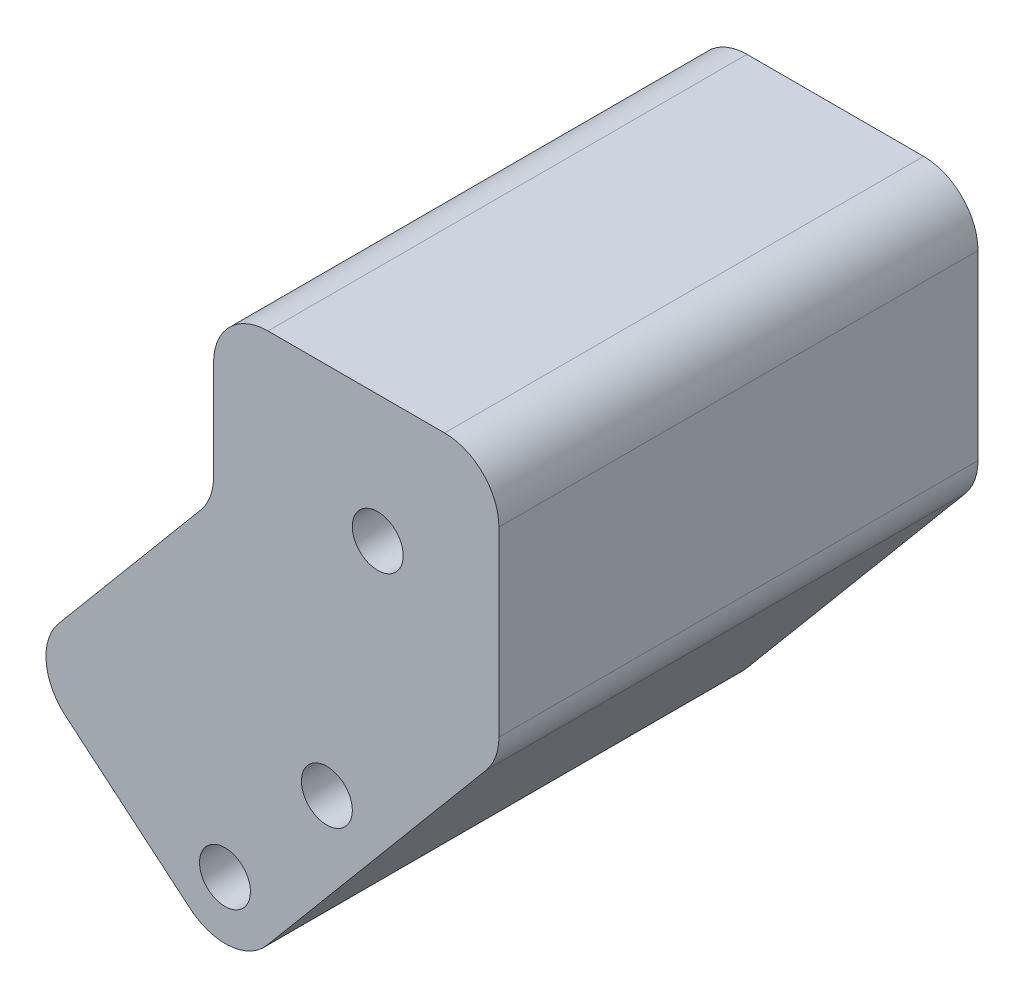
ISO-10303-21;
HEADER;
FILE_DESCRIPTION(('STEP AP214'),'2;1');
FILE_NAME('part.step','',(''),(''),'','','');
FILE_SCHEMA(('AUTOMOTIVE_DESIGN { 1 0 10303 214 1 1 1 1 }'));
ENDSEC;
DATA;
#1=APPLICATION_CONTEXT('core data for automotive mechanical design processes');
#2=APPLICATION_PROTOCOL_DEFINITION('international standard','automotive_design',2000,#1);
#3=PRODUCT_CONTEXT('',#1,'mechanical');
#4=PRODUCT('Part','Part','',(#3));
#5=PRODUCT_RELATED_PRODUCT_CATEGORY('part','',(#4));
#6=PRODUCT_DEFINITION_FORMATION('','',#4);
#7=PRODUCT_DEFINITION_CONTEXT('part definition',#1,'design');
#8=PRODUCT_DEFINITION('design','',#6,#7);
#9=PRODUCT_DEFINITION_SHAPE('','',#8);
#10=(LENGTH_UNIT() NAMED_UNIT(*) SI_UNIT(.MILLI.,.METRE.));
#11=(NAMED_UNIT(*) PLANE_ANGLE_UNIT() SI_UNIT($,.RADIAN.));
#12=(NAMED_UNIT(*) SI_UNIT($,.STERADIAN.) SOLID_ANGLE_UNIT());
#13=UNCERTAINTY_MEASURE_WITH_UNIT(LENGTH_MEASURE(1.E-05),#10,'distance_accuracy_value','');
#14=(GEOMETRIC_REPRESENTATION_CONTEXT(3) GLOBAL_UNCERTAINTY_ASSIGNED_CONTEXT((#13)) GLOBAL_UNIT_ASSIGNED_CONTEXT((#10,
#11,#12)) REPRESENTATION_CONTEXT('',''));
#15=CARTESIAN_POINT('',(0.,0.,0.));
#16=DIRECTION('',(0.,0.,1.));
#17=DIRECTION('',(1.,0.,0.));
#18=AXIS2_PLACEMENT_3D('',#15,#16,#17);
#19=CARTESIAN_POINT('',(-7.60502771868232E-11,2.46469511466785E-11,4.79986189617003));
#20=DIRECTION('',(-1.58417609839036E-11,5.13786431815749E-12,1.));
#21=DIRECTION('',(1.,0.,1.58417609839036E-11));
#22=AXIS2_PLACEMENT_3D('',#19,#20,#21);
#23=PLANE('',#22);
#24=CARTESIAN_POINT('',(-583.738510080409,-82.5166423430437,4.79986188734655));
#25=DIRECTION('',(0.,-5.13786431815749E-12,-1.));
#26=DIRECTION('',(0.,1.,-5.13786431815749E-12));
#27=AXIS2_PLACEMENT_3D('',#24,#25,#26);
#28=CIRCLE('',#27,5.35940000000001);
#29=CARTESIAN_POINT('',(-583.738510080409,-77.1572423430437,4.79986188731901));
#30=VERTEX_POINT('',#29);
#31=EDGE_CURVE('E341',#30,#30,#28,.T.);
#32=ORIENTED_EDGE('',*,*,#31,.F.);
#33=EDGE_LOOP('',(#32));
#34=FACE_BOUND('',#33,.T.);
#35=CARTESIAN_POINT('',(-562.323795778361,-31.0085922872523,4.79986188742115));
#36=DIRECTION('',(0.,-5.13786431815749E-12,-1.));
#37=DIRECTION('',(0.,1.,-5.13786431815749E-12));
#38=AXIS2_PLACEMENT_3D('',#35,#36,#37);
#39=CIRCLE('',#38,5.35940000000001);
#40=CARTESIAN_POINT('',(-562.323795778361,-25.6491922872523,4.79986188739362));
#41=VERTEX_POINT('',#40);
#42=EDGE_CURVE('E325',#41,#41,#39,.T.);
#43=ORIENTED_EDGE('',*,*,#42,.F.);
#44=EDGE_LOOP('',(#43));
#45=FACE_BOUND('',#44,.T.);
#46=CARTESIAN_POINT('',(-569.452555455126,-65.4913045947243,4.79986188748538));
#47=DIRECTION('',(0.,-5.13786431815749E-12,-1.));
#48=DIRECTION('',(0.,1.,-5.13786431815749E-12));
#49=AXIS2_PLACEMENT_3D('',#46,#47,#48);
#50=CIRCLE('',#49,5.35940000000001);
#51=CARTESIAN_POINT('',(-569.452555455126,-60.1319045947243,4.79986188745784));
#52=VERTEX_POINT('',#51);
#53=EDGE_CURVE('E309',#52,#52,#50,.T.);
#54=ORIENTED_EDGE('',*,*,#53,.F.);
#55=EDGE_LOOP('',(#54));
#56=FACE_BOUND('',#55,.T.);
#57=CARTESIAN_POINT('',(-577.716152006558,-20.8198728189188,4.79986188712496));
#58=DIRECTION('',(-1.58417609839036E-11,5.13786431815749E-12,1.));
#59=DIRECTION('',(1.,0.,1.58417609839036E-11));
#60=AXIS2_PLACEMENT_3D('',#57,#58,#59);
#61=CIRCLE('',#60,7.61999999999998);
#62=CARTESIAN_POINT('',(-577.716152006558,-13.1998728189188,4.79986188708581));
#63=VERTEX_POINT('',#62);
#64=CARTESIAN_POINT('',(-585.336152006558,-20.8198728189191,4.79986188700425));
#65=VERTEX_POINT('',#64);
#66=EDGE_CURVE('E136',#63,#65,#61,.T.);
#67=ORIENTED_EDGE('',*,*,#66,.F.);
#68=DIRECTION('',(-1.,0.,-1.58417609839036E-11));
#69=VECTOR('',#68,1.);
#70=CARTESIAN_POINT('',(-577.716152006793,-13.1998728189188,4.79986188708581));
#71=LINE('',#70,#69);
#72=CARTESIAN_POINT('',(-552.951152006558,-13.1998728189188,4.79986188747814));
#73=VERTEX_POINT('',#72);
#74=EDGE_CURVE('E143',#73,#63,#71,.T.);
#75=ORIENTED_EDGE('',*,*,#74,.F.);
#76=CARTESIAN_POINT('',(-552.951152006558,-20.8198728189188,4.79986188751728));
#77=DIRECTION('',(-1.58417609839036E-11,5.13786431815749E-12,1.));
#78=DIRECTION('',(1.,0.,1.58417609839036E-11));
#79=AXIS2_PLACEMENT_3D('',#76,#77,#78);
#80=CIRCLE('',#79,7.61999999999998);
#81=CARTESIAN_POINT('',(-545.331152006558,-20.8198728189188,4.79986188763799));
#82=VERTEX_POINT('',#81);
#83=EDGE_CURVE('E285',#82,#73,#80,.T.);
#84=ORIENTED_EDGE('',*,*,#83,.F.);
#85=DIRECTION('',(0.,1.,-5.13786431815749E-12));
#86=VECTOR('',#85,1.);
#87=CARTESIAN_POINT('',(-545.331152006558,-20.8198728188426,4.79986188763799));
#88=LINE('',#87,#86);
#89=CARTESIAN_POINT('',(-545.331152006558,-46.319640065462,4.79986188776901));
#90=VERTEX_POINT('',#89);
#91=EDGE_CURVE('E281',#90,#82,#88,.T.);
#92=ORIENTED_EDGE('',*,*,#91,.F.);
#93=CARTESIAN_POINT('',(-552.951152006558,-46.319640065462,4.79986188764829));
#94=DIRECTION('',(-1.58417609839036E-11,5.13786431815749E-12,1.));
#95=DIRECTION('',(1.,0.,1.58417609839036E-11));
#96=AXIS2_PLACEMENT_3D('',#93,#94,#95);
#97=CIRCLE('',#96,7.61999999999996);
#98=CARTESIAN_POINT('',(-547.113893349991,-51.2176816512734,4.79986188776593));
#99=VERTEX_POINT('',#98);
#100=EDGE_CURVE('E291',#99,#90,#97,.T.);
#101=ORIENTED_EDGE('',*,*,#100,.F.);
#102=DIRECTION('',(0.642787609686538,0.766044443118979,6.24705526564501E-12));
#103=VECTOR('',#102,1.);
#104=CARTESIAN_POINT('',(-547.113893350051,-51.2176816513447,4.79986188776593));
#105=LINE('',#104,#103);
#106=CARTESIAN_POINT('',(-577.862117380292,-87.8619881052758,4.7998618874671));
#107=VERTEX_POINT('',#106);
#108=EDGE_CURVE('E272',#107,#99,#105,.T.);
#109=ORIENTED_EDGE('',*,*,#108,.F.);
#110=CARTESIAN_POINT('',(-583.699376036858,-82.9639465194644,4.79986188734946));
#111=DIRECTION('',(-1.58417609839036E-11,5.13786431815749E-12,1.));
#112=DIRECTION('',(1.,0.,1.58417609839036E-11));
#113=AXIS2_PLACEMENT_3D('',#110,#111,#112);
#114=CIRCLE('',#113,7.62000000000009);
#115=CARTESIAN_POINT('',(-588.59741762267,-88.801205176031,4.79986188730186));
#116=VERTEX_POINT('',#115);
#117=EDGE_CURVE('E267',#116,#107,#114,.T.);
#118=ORIENTED_EDGE('',*,*,#117,.F.);
#119=DIRECTION('',(0.766044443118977,-0.642787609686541,1.54380484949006E-11));
#120=VECTOR('',#119,1.);
#121=CARTESIAN_POINT('',(-588.597417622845,-88.8012051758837,4.79986188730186));
#122=LINE('',#121,#120);
#123=CARTESIAN_POINT('',(-606.109193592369,-74.1070804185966,4.79986188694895));
#124=VERTEX_POINT('',#123);
#125=EDGE_CURVE('E300',#124,#116,#122,.T.);
#126=ORIENTED_EDGE('',*,*,#125,.F.);
#127=CARTESIAN_POINT('',(-601.211152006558,-68.2698217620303,4.79986188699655));
#128=DIRECTION('',(-1.58417609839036E-11,5.13786431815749E-12,1.));
#129=DIRECTION('',(1.,0.,1.58417609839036E-11));
#130=AXIS2_PLACEMENT_3D('',#127,#128,#129);
#131=CIRCLE('',#130,7.62000000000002);
#132=CARTESIAN_POINT('',(-607.048410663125,-63.3717801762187,4.79986188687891));
#133=VERTEX_POINT('',#132);
#134=EDGE_CURVE('E255',#133,#124,#131,.T.);
#135=ORIENTED_EDGE('',*,*,#134,.F.);
#136=DIRECTION('',(-0.642787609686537,-0.76604444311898,-6.24705526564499E-12));
#137=VECTOR('',#136,1.);
#138=CARTESIAN_POINT('',(-607.048410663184,-63.3717801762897,4.79986188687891));
#139=LINE('',#138,#137);
#140=CARTESIAN_POINT('',(-587.118893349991,-39.6207063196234,4.7998618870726));
#141=VERTEX_POINT('',#140);
#142=EDGE_CURVE('E250',#141,#133,#139,.T.);
#143=ORIENTED_EDGE('',*,*,#142,.F.);
#144=CARTESIAN_POINT('',(-592.956152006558,-34.7226647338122,4.79986188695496));
#145=DIRECTION('',(-1.58417609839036E-11,5.13786431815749E-12,1.));
#146=DIRECTION('',(1.,0.,1.58417609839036E-11));
#147=AXIS2_PLACEMENT_3D('',#144,#145,#146);
#148=CIRCLE('',#147,7.61999999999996);
#149=CARTESIAN_POINT('',(-585.336152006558,-34.7226647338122,4.79986188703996));
#150=VERTEX_POINT('',#149);
#151=EDGE_CURVE('E64',#150,#141,#148,.F.);
#152=ORIENTED_EDGE('',*,*,#151,.F.);
#153=DIRECTION('',(0.,-1.,5.13786431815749E-12));
#154=VECTOR('',#153,1.);
#155=CARTESIAN_POINT('',(-585.336152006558,-34.722664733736,4.79986188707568));
#156=LINE('',#155,#154);
#157=EDGE_CURVE('E12',#65,#150,#156,.T.);
#158=ORIENTED_EDGE('',*,*,#157,.F.);
#159=EDGE_LOOP('',(#67,#75,#84,#92,#101,#109,#118,#126,#135,#143,#152,#158));
#160=FACE_BOUND('',#159,.T.);
#161=ADVANCED_FACE('F48',(#34,#45,#56,#160),#23,.F.);
#162=CARTESIAN_POINT('',(-577.716152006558,-20.8198728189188,-10.033));
#163=DIRECTION('',(0.,0.,1.));
#164=DIRECTION('',(1.,0.,0.));
#165=AXIS2_PLACEMENT_3D('',#162,#163,#164);
#166=CYLINDRICAL_SURFACE('',#165,7.61999999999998);
#167=DIRECTION('',(0.,0.,1.));
#168=VECTOR('',#167,1.);
#169=CARTESIAN_POINT('',(-577.716152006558,-13.1998728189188,-10.033));
#170=LINE('',#169,#168);
#171=CARTESIAN_POINT('',(-577.716152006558,-13.1998728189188,71.9582));
#172=VERTEX_POINT('',#171);
#173=EDGE_CURVE('E57',#63,#172,#170,.T.);
#174=ORIENTED_EDGE('',*,*,#173,.F.);
#175=ORIENTED_EDGE('',*,*,#66,.T.);
#176=DIRECTION('',(0.,0.,1.));
#177=VECTOR('',#176,1.);
#178=CARTESIAN_POINT('',(-585.336152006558,-20.8198728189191,-10.033));
#179=LINE('',#178,#177);
#180=CARTESIAN_POINT('',(-585.336152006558,-20.8198728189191,71.9582));
#181=VERTEX_POINT('',#180);
#182=EDGE_CURVE('E71',#65,#181,#179,.T.);
#183=ORIENTED_EDGE('',*,*,#182,.T.);
#184=CARTESIAN_POINT('',(-577.716152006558,-20.8198728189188,71.9582));
#185=DIRECTION('',(0.,0.,-1.));
#186=DIRECTION('',(-1.,0.,0.));
#187=AXIS2_PLACEMENT_3D('',#184,#185,#186);
#188=CIRCLE('',#187,7.61999999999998);
#189=EDGE_CURVE('E142',#181,#172,#188,.T.);
#190=ORIENTED_EDGE('',*,*,#189,.T.);
#191=EDGE_LOOP('',(#174,#175,#183,#190));
#192=FACE_BOUND('',#191,.T.);
#193=ADVANCED_FACE('F50',(#192),#166,.T.);
#194=CARTESIAN_POINT('',(-577.716152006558,-13.1998728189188,-10.033));
#195=DIRECTION('',(0.,-1.,0.));
#196=DIRECTION('',(1.,0.,0.));
#197=AXIS2_PLACEMENT_3D('',#194,#195,#196);
#198=PLANE('',#197);
#199=DIRECTION('',(0.,0.,1.));
#200=VECTOR('',#199,1.);
#201=CARTESIAN_POINT('',(-552.951152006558,-13.1998728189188,-10.033));
#202=LINE('',#201,#200);
#203=CARTESIAN_POINT('',(-552.951152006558,-13.1998728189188,71.9582));
#204=VERTEX_POINT('',#203);
#205=EDGE_CURVE('E184',#73,#204,#202,.T.);
#206=ORIENTED_EDGE('',*,*,#205,.F.);
#207=ORIENTED_EDGE('',*,*,#74,.T.);
#208=ORIENTED_EDGE('',*,*,#173,.T.);
#209=DIRECTION('',(1.,0.,0.));
#210=VECTOR('',#209,1.);
#211=CARTESIAN_POINT('',(-577.716152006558,-13.1998728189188,71.9582));
#212=LINE('',#211,#210);
#213=EDGE_CURVE('E193',#172,#204,#212,.T.);
#214=ORIENTED_EDGE('',*,*,#213,.T.);
#215=EDGE_LOOP('',(#206,#207,#208,#214));
#216=FACE_BOUND('',#215,.T.);
#217=ADVANCED_FACE('F192',(#216),#198,.F.);
#218=CARTESIAN_POINT('',(-552.951152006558,-20.8198728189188,-10.033));
#219=DIRECTION('',(0.,0.,1.));
#220=DIRECTION('',(1.,0.,0.));
#221=AXIS2_PLACEMENT_3D('',#218,#219,#220);
#222=CYLINDRICAL_SURFACE('',#221,7.61999999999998);
#223=DIRECTION('',(0.,0.,1.));
#224=VECTOR('',#223,1.);
#225=CARTESIAN_POINT('',(-545.331152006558,-20.8198728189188,-10.033));
#226=LINE('',#225,#224);
#227=CARTESIAN_POINT('',(-545.331152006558,-20.8198728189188,71.9582));
#228=VERTEX_POINT('',#227);
#229=EDGE_CURVE('E181',#82,#228,#226,.T.);
#230=ORIENTED_EDGE('',*,*,#229,.F.);
#231=ORIENTED_EDGE('',*,*,#83,.T.);
#232=ORIENTED_EDGE('',*,*,#205,.T.);
#233=CARTESIAN_POINT('',(-552.951152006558,-20.8198728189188,71.9582));
#234=DIRECTION('',(0.,0.,-1.));
#235=DIRECTION('',(-1.,0.,0.));
#236=AXIS2_PLACEMENT_3D('',#233,#234,#235);
#237=CIRCLE('',#236,7.61999999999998);
#238=EDGE_CURVE('E199',#204,#228,#237,.T.);
#239=ORIENTED_EDGE('',*,*,#238,.T.);
#240=EDGE_LOOP('',(#230,#231,#232,#239));
#241=FACE_BOUND('',#240,.T.);
#242=ADVANCED_FACE('F284',(#241),#222,.T.);
#243=CARTESIAN_POINT('',(-545.331152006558,-20.8198728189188,-10.033));
#244=DIRECTION('',(-1.,0.,0.));
#245=DIRECTION('',(0.,0.,1.));
#246=AXIS2_PLACEMENT_3D('',#243,#244,#245);
#247=PLANE('',#246);
#248=DIRECTION('',(0.,0.,1.));
#249=VECTOR('',#248,1.);
#250=CARTESIAN_POINT('',(-545.331152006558,-46.319640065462,-10.033));
#251=LINE('',#250,#249);
#252=CARTESIAN_POINT('',(-545.331152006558,-46.319640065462,71.9582));
#253=VERTEX_POINT('',#252);
#254=EDGE_CURVE('E178',#90,#253,#251,.T.);
#255=ORIENTED_EDGE('',*,*,#254,.F.);
#256=ORIENTED_EDGE('',*,*,#91,.T.);
#257=ORIENTED_EDGE('',*,*,#229,.T.);
#258=DIRECTION('',(0.,-1.,0.));
#259=VECTOR('',#258,1.);
#260=CARTESIAN_POINT('',(-545.331152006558,-20.8198728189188,71.9582));
#261=LINE('',#260,#259);
#262=EDGE_CURVE('E209',#228,#253,#261,.T.);
#263=ORIENTED_EDGE('',*,*,#262,.T.);
#264=EDGE_LOOP('',(#255,#256,#257,#263));
#265=FACE_BOUND('',#264,.T.);
#266=ADVANCED_FACE('F278',(#265),#247,.F.);
#267=CARTESIAN_POINT('',(-552.951152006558,-46.319640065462,-10.033));
#268=DIRECTION('',(0.,0.,1.));
#269=DIRECTION('',(1.,0.,0.));
#270=AXIS2_PLACEMENT_3D('',#267,#268,#269);
#271=CYLINDRICAL_SURFACE('',#270,7.61999999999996);
#272=DIRECTION('',(0.,0.,1.));
#273=VECTOR('',#272,1.);
#274=CARTESIAN_POINT('',(-547.113893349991,-51.2176816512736,-10.033));
#275=LINE('',#274,#273);
#276=CARTESIAN_POINT('',(-547.113893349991,-51.2176816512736,71.9582));
#277=VERTEX_POINT('',#276);
#278=EDGE_CURVE('E175',#99,#277,#275,.T.);
#279=ORIENTED_EDGE('',*,*,#278,.F.);
#280=ORIENTED_EDGE('',*,*,#100,.T.);
#281=ORIENTED_EDGE('',*,*,#254,.T.);
#282=CARTESIAN_POINT('',(-552.951152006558,-46.319640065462,71.9582));
#283=DIRECTION('',(0.,0.,-1.));
#284=DIRECTION('',(-1.,0.,0.));
#285=AXIS2_PLACEMENT_3D('',#282,#283,#284);
#286=CIRCLE('',#285,7.61999999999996);
#287=EDGE_CURVE('E213',#253,#277,#286,.T.);
#288=ORIENTED_EDGE('',*,*,#287,.T.);
#289=EDGE_LOOP('',(#279,#280,#281,#288));
#290=FACE_BOUND('',#289,.T.);
#291=ADVANCED_FACE('F275',(#290),#271,.T.);
#292=CARTESIAN_POINT('',(-547.113893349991,-51.2176816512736,-10.033));
#293=DIRECTION('',(-0.766044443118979,0.642787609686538,0.));
#294=DIRECTION('',(-0.642787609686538,-0.766044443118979,0.));
#295=AXIS2_PLACEMENT_3D('',#292,#293,#294);
#296=PLANE('',#295);
#297=DIRECTION('',(0.,0.,1.));
#298=VECTOR('',#297,1.);
#299=CARTESIAN_POINT('',(-577.862117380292,-87.8619881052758,-10.033));
#300=LINE('',#299,#298);
#301=CARTESIAN_POINT('',(-577.862117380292,-87.8619881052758,71.9582));
#302=VERTEX_POINT('',#301);
#303=EDGE_CURVE('E172',#107,#302,#300,.T.);
#304=ORIENTED_EDGE('',*,*,#303,.F.);
#305=ORIENTED_EDGE('',*,*,#108,.T.);
#306=ORIENTED_EDGE('',*,*,#278,.T.);
#307=DIRECTION('',(-0.642787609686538,-0.766044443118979,0.));
#308=VECTOR('',#307,1.);
#309=CARTESIAN_POINT('',(-547.113893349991,-51.2176816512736,71.9582));
#310=LINE('',#309,#308);
#311=EDGE_CURVE('E217',#277,#302,#310,.T.);
#312=ORIENTED_EDGE('',*,*,#311,.T.);
#313=EDGE_LOOP('',(#304,#305,#306,#312));
#314=FACE_BOUND('',#313,.T.);
#315=ADVANCED_FACE('F270',(#314),#296,.F.);
#316=CARTESIAN_POINT('',(-583.699376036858,-82.9639465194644,-10.033));
#317=DIRECTION('',(0.,0.,1.));
#318=DIRECTION('',(1.,0.,0.));
#319=AXIS2_PLACEMENT_3D('',#316,#317,#318);
#320=CYLINDRICAL_SURFACE('',#319,7.62000000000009);
#321=DIRECTION('',(0.,0.,1.));
#322=VECTOR('',#321,1.);
#323=CARTESIAN_POINT('',(-588.59741762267,-88.801205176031,-10.033));
#324=LINE('',#323,#322);
#325=CARTESIAN_POINT('',(-588.59741762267,-88.801205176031,71.9582));
#326=VERTEX_POINT('',#325);
#327=EDGE_CURVE('E169',#116,#326,#324,.T.);
#328=ORIENTED_EDGE('',*,*,#327,.F.);
#329=ORIENTED_EDGE('',*,*,#117,.T.);
#330=ORIENTED_EDGE('',*,*,#303,.T.);
#331=CARTESIAN_POINT('',(-583.699376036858,-82.9639465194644,71.9582));
#332=DIRECTION('',(0.,0.,-1.));
#333=DIRECTION('',(-1.,0.,0.));
#334=AXIS2_PLACEMENT_3D('',#331,#332,#333);
#335=CIRCLE('',#334,7.62000000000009);
#336=EDGE_CURVE('E221',#302,#326,#335,.T.);
#337=ORIENTED_EDGE('',*,*,#336,.T.);
#338=EDGE_LOOP('',(#328,#329,#330,#337));
#339=FACE_BOUND('',#338,.T.);
#340=ADVANCED_FACE('F264',(#339),#320,.T.);
#341=CARTESIAN_POINT('',(-588.59741762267,-88.801205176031,-10.033));
#342=DIRECTION('',(0.642787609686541,0.766044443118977,0.));
#343=DIRECTION('',(-0.766044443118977,0.642787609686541,0.));
#344=AXIS2_PLACEMENT_3D('',#341,#342,#343);
#345=PLANE('',#344);
#346=DIRECTION('',(0.,0.,1.));
#347=VECTOR('',#346,1.);
#348=CARTESIAN_POINT('',(-606.109193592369,-74.1070804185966,-10.033));
#349=LINE('',#348,#347);
#350=CARTESIAN_POINT('',(-606.109193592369,-74.1070804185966,71.9582));
#351=VERTEX_POINT('',#350);
#352=EDGE_CURVE('E166',#124,#351,#349,.T.);
#353=ORIENTED_EDGE('',*,*,#352,.F.);
#354=ORIENTED_EDGE('',*,*,#125,.T.);
#355=ORIENTED_EDGE('',*,*,#327,.T.);
#356=DIRECTION('',(-0.766044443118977,0.642787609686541,0.));
#357=VECTOR('',#356,1.);
#358=CARTESIAN_POINT('',(-588.59741762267,-88.801205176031,71.9582));
#359=LINE('',#358,#357);
#360=EDGE_CURVE('E225',#326,#351,#359,.T.);
#361=ORIENTED_EDGE('',*,*,#360,.T.);
#362=EDGE_LOOP('',(#353,#354,#355,#361));
#363=FACE_BOUND('',#362,.T.);
#364=ADVANCED_FACE('F258',(#363),#345,.F.);
#365=CARTESIAN_POINT('',(-601.211152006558,-68.2698217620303,-10.033));
#366=DIRECTION('',(0.,0.,1.));
#367=DIRECTION('',(1.,0.,0.));
#368=AXIS2_PLACEMENT_3D('',#365,#366,#367);
#369=CYLINDRICAL_SURFACE('',#368,7.62000000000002);
#370=DIRECTION('',(0.,0.,1.));
#371=VECTOR('',#370,1.);
#372=CARTESIAN_POINT('',(-607.048410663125,-63.3717801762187,-10.033));
#373=LINE('',#372,#371);
#374=CARTESIAN_POINT('',(-607.048410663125,-63.3717801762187,71.9582));
#375=VERTEX_POINT('',#374);
#376=EDGE_CURVE('E163',#133,#375,#373,.T.);
#377=ORIENTED_EDGE('',*,*,#376,.F.);
#378=ORIENTED_EDGE('',*,*,#134,.T.);
#379=ORIENTED_EDGE('',*,*,#352,.T.);
#380=CARTESIAN_POINT('',(-601.211152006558,-68.2698217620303,71.9582));
#381=DIRECTION('',(0.,0.,-1.));
#382=DIRECTION('',(-1.,0.,0.));
#383=AXIS2_PLACEMENT_3D('',#380,#381,#382);
#384=CIRCLE('',#383,7.62000000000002);
#385=EDGE_CURVE('E229',#351,#375,#384,.T.);
#386=ORIENTED_EDGE('',*,*,#385,.T.);
#387=EDGE_LOOP('',(#377,#378,#379,#386));
#388=FACE_BOUND('',#387,.T.);
#389=ADVANCED_FACE('F253',(#388),#369,.T.);
#390=CARTESIAN_POINT('',(-607.048410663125,-63.3717801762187,-10.033));
#391=DIRECTION('',(0.76604444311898,-0.642787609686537,0.));
#392=DIRECTION('',(0.642787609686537,0.76604444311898,0.));
#393=AXIS2_PLACEMENT_3D('',#390,#391,#392);
#394=PLANE('',#393);
#395=DIRECTION('',(0.,0.,1.));
#396=VECTOR('',#395,1.);
#397=CARTESIAN_POINT('',(-587.118893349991,-39.6207063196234,-10.033));
#398=LINE('',#397,#396);
#399=CARTESIAN_POINT('',(-587.118893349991,-39.6207063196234,71.9582));
#400=VERTEX_POINT('',#399);
#401=EDGE_CURVE('E155',#141,#400,#398,.T.);
#402=ORIENTED_EDGE('',*,*,#401,.F.);
#403=ORIENTED_EDGE('',*,*,#142,.T.);
#404=ORIENTED_EDGE('',*,*,#376,.T.);
#405=DIRECTION('',(0.642787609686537,0.76604444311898,0.));
#406=VECTOR('',#405,1.);
#407=CARTESIAN_POINT('',(-607.048410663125,-63.3717801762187,71.9582));
#408=LINE('',#407,#406);
#409=EDGE_CURVE('E233',#375,#400,#408,.T.);
#410=ORIENTED_EDGE('',*,*,#409,.T.);
#411=EDGE_LOOP('',(#402,#403,#404,#410));
#412=FACE_BOUND('',#411,.T.);
#413=ADVANCED_FACE('F247',(#412),#394,.F.);
#414=CARTESIAN_POINT('',(-592.956152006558,-34.7226647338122,-10.033));
#415=DIRECTION('',(0.,0.,1.));
#416=DIRECTION('',(1.,0.,0.));
#417=AXIS2_PLACEMENT_3D('',#414,#415,#416);
#418=CYLINDRICAL_SURFACE('',#417,7.61999999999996);
#419=DIRECTION('',(0.,0.,1.));
#420=VECTOR('',#419,1.);
#421=CARTESIAN_POINT('',(-585.336152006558,-34.7226647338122,-10.033));
#422=LINE('',#421,#420);
#423=CARTESIAN_POINT('',(-585.336152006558,-34.7226647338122,71.9582));
#424=VERTEX_POINT('',#423);
#425=EDGE_CURVE('E150',#150,#424,#422,.T.);
#426=ORIENTED_EDGE('',*,*,#425,.F.);
#427=ORIENTED_EDGE('',*,*,#151,.T.);
#428=ORIENTED_EDGE('',*,*,#401,.T.);
#429=CARTESIAN_POINT('',(-592.956152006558,-34.7226647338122,71.9582));
#430=DIRECTION('',(0.,0.,1.));
#431=DIRECTION('',(-1.,0.,0.));
#432=AXIS2_PLACEMENT_3D('',#429,#430,#431);
#433=CIRCLE('',#432,7.61999999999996);
#434=EDGE_CURVE('E157',#400,#424,#433,.T.);
#435=ORIENTED_EDGE('',*,*,#434,.T.);
#436=EDGE_LOOP('',(#426,#427,#428,#435));
#437=FACE_BOUND('',#436,.T.);
#438=ADVANCED_FACE('F241',(#437),#418,.F.);
#439=CARTESIAN_POINT('',(-585.336152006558,-34.7226647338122,-10.033));
#440=DIRECTION('',(1.,0.,0.));
#441=DIRECTION('',(0.,0.,-1.));
#442=AXIS2_PLACEMENT_3D('',#439,#440,#441);
#443=PLANE('',#442);
#444=ORIENTED_EDGE('',*,*,#182,.F.);
#445=ORIENTED_EDGE('',*,*,#157,.T.);
#446=ORIENTED_EDGE('',*,*,#425,.T.);
#447=DIRECTION('',(0.,1.,0.));
#448=VECTOR('',#447,1.);
#449=CARTESIAN_POINT('',(-585.336152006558,-34.7226647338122,71.9582));
#450=LINE('',#449,#448);
#451=EDGE_CURVE('E147',#424,#181,#450,.T.);
#452=ORIENTED_EDGE('',*,*,#451,.T.);
#453=EDGE_LOOP('',(#444,#445,#446,#452));
#454=FACE_BOUND('',#453,.T.);
#455=ADVANCED_FACE('F145',(#454),#443,.F.);
#456=CARTESIAN_POINT('',(-577.716152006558,-20.8198728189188,71.9582));
#457=DIRECTION('',(0.,0.,-1.));
#458=DIRECTION('',(-1.,0.,0.));
#459=AXIS2_PLACEMENT_3D('',#456,#457,#458);
#460=PLANE('',#459);
#461=CARTESIAN_POINT('',(-583.738510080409,-82.5166423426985,71.9582000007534));
#462=DIRECTION('',(0.,-5.13786431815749E-12,-1.));
#463=DIRECTION('',(0.,1.,-5.13786431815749E-12));
#464=AXIS2_PLACEMENT_3D('',#461,#462,#463);
#465=CIRCLE('',#464,3.56869999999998);
#466=CARTESIAN_POINT('',(-583.738510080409,-78.9479423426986,71.9582000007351));
#467=VERTEX_POINT('',#466);
#468=EDGE_CURVE('E353',#467,#467,#465,.T.);
#469=ORIENTED_EDGE('',*,*,#468,.T.);
#470=EDGE_LOOP('',(#469));
#471=FACE_BOUND('',#470,.T.);
#472=CARTESIAN_POINT('',(-562.323795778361,-31.0085922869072,71.958200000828));
#473=DIRECTION('',(0.,-5.13786431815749E-12,-1.));
#474=DIRECTION('',(0.,1.,-5.13786431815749E-12));
#475=AXIS2_PLACEMENT_3D('',#472,#473,#474);
#476=CIRCLE('',#475,3.56869999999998);
#477=CARTESIAN_POINT('',(-562.323795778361,-27.4398922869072,71.9582000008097));
#478=VERTEX_POINT('',#477);
#479=EDGE_CURVE('E337',#478,#478,#476,.T.);
#480=ORIENTED_EDGE('',*,*,#479,.T.);
#481=EDGE_LOOP('',(#480));
#482=FACE_BOUND('',#481,.T.);
#483=CARTESIAN_POINT('',(-569.452555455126,-65.4913045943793,71.9582000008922));
#484=DIRECTION('',(0.,-5.13786431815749E-12,-1.));
#485=DIRECTION('',(0.,1.,-5.13786431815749E-12));
#486=AXIS2_PLACEMENT_3D('',#483,#484,#485);
#487=CIRCLE('',#486,3.56869999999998);
#488=CARTESIAN_POINT('',(-569.452555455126,-61.9226045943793,71.9582000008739));
#489=VERTEX_POINT('',#488);
#490=EDGE_CURVE('E321',#489,#489,#487,.T.);
#491=ORIENTED_EDGE('',*,*,#490,.T.);
#492=EDGE_LOOP('',(#491));
#493=FACE_BOUND('',#492,.T.);
#494=ORIENTED_EDGE('',*,*,#189,.F.);
#495=ORIENTED_EDGE('',*,*,#451,.F.);
#496=ORIENTED_EDGE('',*,*,#434,.F.);
#497=ORIENTED_EDGE('',*,*,#409,.F.);
#498=ORIENTED_EDGE('',*,*,#385,.F.);
#499=ORIENTED_EDGE('',*,*,#360,.F.);
#500=ORIENTED_EDGE('',*,*,#336,.F.);
#501=ORIENTED_EDGE('',*,*,#311,.F.);
#502=ORIENTED_EDGE('',*,*,#287,.F.);
#503=ORIENTED_EDGE('',*,*,#262,.F.);
#504=ORIENTED_EDGE('',*,*,#238,.F.);
#505=ORIENTED_EDGE('',*,*,#213,.F.);
#506=EDGE_LOOP('',(#494,#495,#496,#497,#498,#499,#500,#501,#502,#503,#504,#505));
#507=FACE_BOUND('',#506,.T.);
#508=ADVANCED_FACE('F196',(#471,#482,#493,#507),#460,.F.);
#509=CARTESIAN_POINT('',(-569.452555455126,-65.4913045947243,4.79986188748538));
#510=DIRECTION('',(0.,-5.13786431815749E-12,-1.));
#511=DIRECTION('',(0.,1.,-5.13786431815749E-12));
#512=AXIS2_PLACEMENT_3D('',#509,#510,#511);
#513=CYLINDRICAL_SURFACE('',#512,5.35940000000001);
#514=CARTESIAN_POINT('',(-569.452555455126,-65.4913045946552,18.2618618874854));
#515=DIRECTION('',(0.,-5.13786431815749E-12,-1.));
#516=DIRECTION('',(0.,1.,-5.13786431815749E-12));
#517=AXIS2_PLACEMENT_3D('',#514,#515,#516);
#518=CIRCLE('',#517,5.35940000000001);
#519=CARTESIAN_POINT('',(-569.452555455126,-60.1319045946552,18.2618618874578));
#520=VERTEX_POINT('',#519);
#521=EDGE_CURVE('E313',#520,#520,#518,.T.);
#522=ORIENTED_EDGE('',*,*,#521,.F.);
#523=EDGE_LOOP('',(#522));
#524=FACE_BOUND('',#523,.T.);
#525=ORIENTED_EDGE('',*,*,#53,.T.);
#526=EDGE_LOOP('',(#525));
#527=FACE_BOUND('',#526,.T.);
#528=ADVANCED_FACE('F387',(#524,#527),#513,.F.);
#529=CARTESIAN_POINT('',(-565.883855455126,-65.4913045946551,18.2618618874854));
#530=DIRECTION('',(0.,5.13786431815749E-12,1.));
#531=DIRECTION('',(0.,-1.,5.13786431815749E-12));
#532=AXIS2_PLACEMENT_3D('',#529,#530,#531);
#533=PLANE('',#532);
#534=CARTESIAN_POINT('',(-569.452555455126,-65.4913045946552,18.2618618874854));
#535=DIRECTION('',(0.,-5.13786431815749E-12,-1.));
#536=DIRECTION('',(0.,1.,-5.13786431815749E-12));
#537=AXIS2_PLACEMENT_3D('',#534,#535,#536);
#538=CIRCLE('',#537,3.56869999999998);
#539=CARTESIAN_POINT('',(-569.452555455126,-61.9226045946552,18.261861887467));
#540=VERTEX_POINT('',#539);
#541=EDGE_CURVE('E317',#540,#540,#538,.T.);
#542=ORIENTED_EDGE('',*,*,#541,.F.);
#543=EDGE_LOOP('',(#542));
#544=FACE_BOUND('',#543,.T.);
#545=ORIENTED_EDGE('',*,*,#521,.T.);
#546=EDGE_LOOP('',(#545));
#547=FACE_BOUND('',#546,.T.);
#548=ADVANCED_FACE('F389',(#544,#547),#533,.F.);
#549=CARTESIAN_POINT('',(-569.452555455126,-65.4913045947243,4.79986188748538));
#550=DIRECTION('',(0.,-5.13786431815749E-12,-1.));
#551=DIRECTION('',(0.,1.,-5.13786431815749E-12));
#552=AXIS2_PLACEMENT_3D('',#549,#550,#551);
#553=CYLINDRICAL_SURFACE('',#552,3.56869999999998);
#554=ORIENTED_EDGE('',*,*,#490,.F.);
#555=EDGE_LOOP('',(#554));
#556=FACE_BOUND('',#555,.T.);
#557=ORIENTED_EDGE('',*,*,#541,.T.);
#558=EDGE_LOOP('',(#557));
#559=FACE_BOUND('',#558,.T.);
#560=ADVANCED_FACE('F396',(#556,#559),#553,.F.);
#561=CARTESIAN_POINT('',(-562.323795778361,-31.0085922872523,4.79986188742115));
#562=DIRECTION('',(0.,-5.13786431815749E-12,-1.));
#563=DIRECTION('',(0.,1.,-5.13786431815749E-12));
#564=AXIS2_PLACEMENT_3D('',#561,#562,#563);
#565=CYLINDRICAL_SURFACE('',#564,5.35940000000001);
#566=CARTESIAN_POINT('',(-562.323795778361,-31.0085922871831,18.2618618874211));
#567=DIRECTION('',(0.,-5.13786431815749E-12,-1.));
#568=DIRECTION('',(0.,1.,-5.13786431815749E-12));
#569=AXIS2_PLACEMENT_3D('',#566,#567,#568);
#570=CIRCLE('',#569,5.35940000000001);
#571=CARTESIAN_POINT('',(-562.323795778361,-25.6491922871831,18.2618618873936));
#572=VERTEX_POINT('',#571);
#573=EDGE_CURVE('E329',#572,#572,#570,.T.);
#574=ORIENTED_EDGE('',*,*,#573,.F.);
#575=EDGE_LOOP('',(#574));
#576=FACE_BOUND('',#575,.T.);
#577=ORIENTED_EDGE('',*,*,#42,.T.);
#578=EDGE_LOOP('',(#577));
#579=FACE_BOUND('',#578,.T.);
#580=ADVANCED_FACE('F494',(#576,#579),#565,.F.);
#581=CARTESIAN_POINT('',(-558.755095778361,-31.0085922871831,18.2618618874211));
#582=DIRECTION('',(0.,5.13786431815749E-12,1.));
#583=DIRECTION('',(0.,-1.,5.13786431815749E-12));
#584=AXIS2_PLACEMENT_3D('',#581,#582,#583);
#585=PLANE('',#584);
#586=CARTESIAN_POINT('',(-562.323795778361,-31.0085922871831,18.2618618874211));
#587=DIRECTION('',(0.,-5.13786431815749E-12,-1.));
#588=DIRECTION('',(0.,1.,-5.13786431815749E-12));
#589=AXIS2_PLACEMENT_3D('',#586,#587,#588);
#590=CIRCLE('',#589,3.56869999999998);
#591=CARTESIAN_POINT('',(-562.323795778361,-27.4398922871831,18.2618618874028));
#592=VERTEX_POINT('',#591);
#593=EDGE_CURVE('E333',#592,#592,#590,.T.);
#594=ORIENTED_EDGE('',*,*,#593,.F.);
#595=EDGE_LOOP('',(#594));
#596=FACE_BOUND('',#595,.T.);
#597=ORIENTED_EDGE('',*,*,#573,.T.);
#598=EDGE_LOOP('',(#597));
#599=FACE_BOUND('',#598,.T.);
#600=ADVANCED_FACE('F502',(#596,#599),#585,.F.);
#601=CARTESIAN_POINT('',(-562.323795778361,-31.0085922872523,4.79986188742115));
#602=DIRECTION('',(0.,-5.13786431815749E-12,-1.));
#603=DIRECTION('',(0.,1.,-5.13786431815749E-12));
#604=AXIS2_PLACEMENT_3D('',#601,#602,#603);
#605=CYLINDRICAL_SURFACE('',#604,3.56869999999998);
#606=ORIENTED_EDGE('',*,*,#479,.F.);
#607=EDGE_LOOP('',(#606));
#608=FACE_BOUND('',#607,.T.);
#609=ORIENTED_EDGE('',*,*,#593,.T.);
#610=EDGE_LOOP('',(#609));
#611=FACE_BOUND('',#610,.T.);
#612=ADVANCED_FACE('F376',(#608,#611),#605,.F.);
#613=CARTESIAN_POINT('',(-583.738510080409,-82.5166423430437,4.79986188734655));
#614=DIRECTION('',(0.,-5.13786431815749E-12,-1.));
#615=DIRECTION('',(0.,1.,-5.13786431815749E-12));
#616=AXIS2_PLACEMENT_3D('',#613,#614,#615);
#617=CYLINDRICAL_SURFACE('',#616,5.35940000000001);
#618=CARTESIAN_POINT('',(-583.738510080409,-82.5166423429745,18.2618618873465));
#619=DIRECTION('',(0.,-5.13786431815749E-12,-1.));
#620=DIRECTION('',(0.,1.,-5.13786431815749E-12));
#621=AXIS2_PLACEMENT_3D('',#618,#619,#620);
#622=CIRCLE('',#621,5.35940000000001);
#623=CARTESIAN_POINT('',(-583.738510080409,-77.1572423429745,18.261861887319));
#624=VERTEX_POINT('',#623);
#625=EDGE_CURVE('E345',#624,#624,#622,.T.);
#626=ORIENTED_EDGE('',*,*,#625,.F.);
#627=EDGE_LOOP('',(#626));
#628=FACE_BOUND('',#627,.T.);
#629=ORIENTED_EDGE('',*,*,#31,.T.);
#630=EDGE_LOOP('',(#629));
#631=FACE_BOUND('',#630,.T.);
#632=ADVANCED_FACE('F370',(#628,#631),#617,.F.);
#633=CARTESIAN_POINT('',(-580.169810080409,-82.5166423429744,18.2618618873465));
#634=DIRECTION('',(0.,5.13786431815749E-12,1.));
#635=DIRECTION('',(0.,-1.,5.13786431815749E-12));
#636=AXIS2_PLACEMENT_3D('',#633,#634,#635);
#637=PLANE('',#636);
#638=CARTESIAN_POINT('',(-583.738510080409,-82.5166423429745,18.2618618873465));
#639=DIRECTION('',(0.,-5.13786431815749E-12,-1.));
#640=DIRECTION('',(0.,1.,-5.13786431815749E-12));
#641=AXIS2_PLACEMENT_3D('',#638,#639,#640);
#642=CIRCLE('',#641,3.56869999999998);
#643=CARTESIAN_POINT('',(-583.738510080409,-78.9479423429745,18.2618618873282));
#644=VERTEX_POINT('',#643);
#645=EDGE_CURVE('E349',#644,#644,#642,.T.);
#646=ORIENTED_EDGE('',*,*,#645,.F.);
#647=EDGE_LOOP('',(#646));
#648=FACE_BOUND('',#647,.T.);
#649=ORIENTED_EDGE('',*,*,#625,.T.);
#650=EDGE_LOOP('',(#649));
#651=FACE_BOUND('',#650,.T.);
#652=ADVANCED_FACE('F364',(#648,#651),#637,.F.);
#653=CARTESIAN_POINT('',(-583.738510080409,-82.5166423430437,4.79986188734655));
#654=DIRECTION('',(0.,-5.13786431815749E-12,-1.));
#655=DIRECTION('',(0.,1.,-5.13786431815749E-12));
#656=AXIS2_PLACEMENT_3D('',#653,#654,#655);
#657=CYLINDRICAL_SURFACE('',#656,3.56869999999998);
#658=ORIENTED_EDGE('',*,*,#468,.F.);
#659=EDGE_LOOP('',(#658));
#660=FACE_BOUND('',#659,.T.);
#661=ORIENTED_EDGE('',*,*,#645,.T.);
#662=EDGE_LOOP('',(#661));
#663=FACE_BOUND('',#662,.T.);
#664=ADVANCED_FACE('F361',(#660,#663),#657,.F.);
#665=CLOSED_SHELL('',(#161,#193,#217,#242,#266,#291,#315,#340,#364,#389,#413,#438,#455,#508,
#528,#548,#560,#580,#600,#612,#632,#652,#664));
#666=MANIFOLD_SOLID_BREP('B2',#665);
#667=ADVANCED_BREP_SHAPE_REPRESENTATION('',(#18,#666),#14);
#668=SHAPE_DEFINITION_REPRESENTATION(#9,#667);
ENDSEC;
END-ISO-10303-21;
